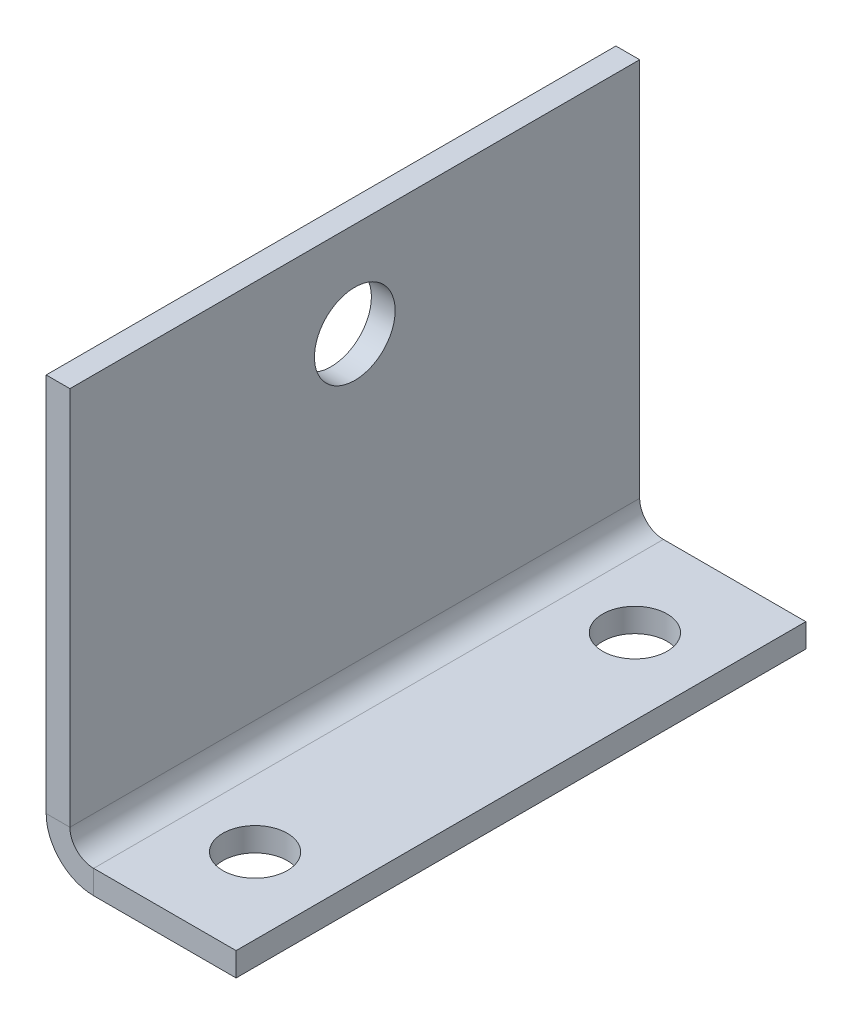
ISO-10303-21;
HEADER;
FILE_DESCRIPTION(('STEP AP214'),'2;1');
FILE_NAME('part.step','',(''),(''),'','','');
FILE_SCHEMA(('AUTOMOTIVE_DESIGN { 1 0 10303 214 1 1 1 1 }'));
ENDSEC;
DATA;
#1=APPLICATION_CONTEXT('core data for automotive mechanical design processes');
#2=APPLICATION_PROTOCOL_DEFINITION('international standard','automotive_design',2000,#1);
#3=PRODUCT_CONTEXT('',#1,'mechanical');
#4=PRODUCT('Part','Part','',(#3));
#5=PRODUCT_RELATED_PRODUCT_CATEGORY('part','',(#4));
#6=PRODUCT_DEFINITION_FORMATION('','',#4);
#7=PRODUCT_DEFINITION_CONTEXT('part definition',#1,'design');
#8=PRODUCT_DEFINITION('design','',#6,#7);
#9=PRODUCT_DEFINITION_SHAPE('','',#8);
#10=(LENGTH_UNIT() NAMED_UNIT(*) SI_UNIT(.MILLI.,.METRE.));
#11=(NAMED_UNIT(*) PLANE_ANGLE_UNIT() SI_UNIT($,.RADIAN.));
#12=(NAMED_UNIT(*) SI_UNIT($,.STERADIAN.) SOLID_ANGLE_UNIT());
#13=UNCERTAINTY_MEASURE_WITH_UNIT(LENGTH_MEASURE(1.E-05),#10,'distance_accuracy_value','');
#14=(GEOMETRIC_REPRESENTATION_CONTEXT(3) GLOBAL_UNCERTAINTY_ASSIGNED_CONTEXT((#13)) GLOBAL_UNIT_ASSIGNED_CONTEXT((#10,
#11,#12)) REPRESENTATION_CONTEXT('',''));
#15=CARTESIAN_POINT('',(0.,0.,0.));
#16=DIRECTION('',(0.,0.,1.));
#17=DIRECTION('',(1.,0.,0.));
#18=AXIS2_PLACEMENT_3D('',#15,#16,#17);
#19=CARTESIAN_POINT('',(-20.,4.99999999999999,30.));
#20=DIRECTION('',(0.,0.,1.));
#21=DIRECTION('',(1.,0.,0.));
#22=AXIS2_PLACEMENT_3D('',#19,#20,#21);
#23=PLANE('',#22);
#24=DIRECTION('',(1.,0.,0.));
#25=VECTOR('',#24,1.);
#26=CARTESIAN_POINT('',(-20.,4.99999999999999,30.));
#27=LINE('',#26,#25);
#28=CARTESIAN_POINT('',(-20.,4.99999999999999,30.));
#29=VERTEX_POINT('',#28);
#30=CARTESIAN_POINT('',(-17.5,4.99999999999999,30.));
#31=VERTEX_POINT('',#30);
#32=EDGE_CURVE('E11',#29,#31,#27,.T.);
#33=ORIENTED_EDGE('',*,*,#32,.F.);
#34=CARTESIAN_POINT('',(-15.,5.,30.));
#35=DIRECTION('',(0.,0.,1.));
#36=DIRECTION('',(1.,0.,0.));
#37=AXIS2_PLACEMENT_3D('',#34,#35,#36);
#38=CIRCLE('',#37,5.);
#39=CARTESIAN_POINT('',(-15.,0.,30.));
#40=VERTEX_POINT('',#39);
#41=EDGE_CURVE('E164',#40,#29,#38,.F.);
#42=ORIENTED_EDGE('',*,*,#41,.F.);
#43=DIRECTION('',(0.,-1.,0.));
#44=VECTOR('',#43,1.);
#45=CARTESIAN_POINT('',(-15.,2.5,30.));
#46=LINE('',#45,#44);
#47=CARTESIAN_POINT('',(-15.,2.5,30.));
#48=VERTEX_POINT('',#47);
#49=EDGE_CURVE('E46',#48,#40,#46,.T.);
#50=ORIENTED_EDGE('',*,*,#49,.F.);
#51=CARTESIAN_POINT('',(-15.,5.,30.));
#52=DIRECTION('',(0.,0.,1.));
#53=DIRECTION('',(1.,0.,0.));
#54=AXIS2_PLACEMENT_3D('',#51,#52,#53);
#55=CIRCLE('',#54,2.5);
#56=EDGE_CURVE('E178',#48,#31,#55,.F.);
#57=ORIENTED_EDGE('',*,*,#56,.T.);
#58=EDGE_LOOP('',(#33,#42,#50,#57));
#59=FACE_BOUND('',#58,.T.);
#60=ADVANCED_FACE('F38',(#59),#23,.T.);
#61=CARTESIAN_POINT('',(-15.,2.5,30.));
#62=DIRECTION('',(0.,0.,1.));
#63=DIRECTION('',(1.,0.,0.));
#64=AXIS2_PLACEMENT_3D('',#61,#62,#63);
#65=PLANE('',#64);
#66=DIRECTION('',(0.,1.,0.));
#67=VECTOR('',#66,1.);
#68=CARTESIAN_POINT('',(-20.,0.,30.));
#69=LINE('',#68,#67);
#70=CARTESIAN_POINT('',(-20.,45.,30.));
#71=VERTEX_POINT('',#70);
#72=EDGE_CURVE('E160',#29,#71,#69,.T.);
#73=ORIENTED_EDGE('',*,*,#72,.F.);
#74=ORIENTED_EDGE('',*,*,#32,.T.);
#75=DIRECTION('',(0.,1.,0.));
#76=VECTOR('',#75,1.);
#77=CARTESIAN_POINT('',(-17.5,0.,30.));
#78=LINE('',#77,#76);
#79=CARTESIAN_POINT('',(-17.5,45.,30.));
#80=VERTEX_POINT('',#79);
#81=EDGE_CURVE('E155',#31,#80,#78,.T.);
#82=ORIENTED_EDGE('',*,*,#81,.T.);
#83=DIRECTION('',(1.,0.,0.));
#84=VECTOR('',#83,1.);
#85=CARTESIAN_POINT('',(-20.,45.,30.));
#86=LINE('',#85,#84);
#87=EDGE_CURVE('E108',#71,#80,#86,.T.);
#88=ORIENTED_EDGE('',*,*,#87,.F.);
#89=EDGE_LOOP('',(#73,#74,#82,#88));
#90=FACE_BOUND('',#89,.T.);
#91=ADVANCED_FACE('F232',(#90),#65,.T.);
#92=CARTESIAN_POINT('',(-15.,0.,-30.));
#93=DIRECTION('',(0.,0.,-1.));
#94=DIRECTION('',(-1.,0.,0.));
#95=AXIS2_PLACEMENT_3D('',#92,#93,#94);
#96=PLANE('',#95);
#97=DIRECTION('',(0.,1.,0.));
#98=VECTOR('',#97,1.);
#99=CARTESIAN_POINT('',(-15.,0.,-30.));
#100=LINE('',#99,#98);
#101=CARTESIAN_POINT('',(-15.,0.,-30.));
#102=VERTEX_POINT('',#101);
#103=CARTESIAN_POINT('',(-15.,2.5,-30.));
#104=VERTEX_POINT('',#103);
#105=EDGE_CURVE('E205',#102,#104,#100,.T.);
#106=ORIENTED_EDGE('',*,*,#105,.F.);
#107=CARTESIAN_POINT('',(-15.,5.,-30.));
#108=DIRECTION('',(0.,0.,1.));
#109=DIRECTION('',(1.,0.,0.));
#110=AXIS2_PLACEMENT_3D('',#107,#108,#109);
#111=CIRCLE('',#110,5.);
#112=CARTESIAN_POINT('',(-20.,4.99999999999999,-30.));
#113=VERTEX_POINT('',#112);
#114=EDGE_CURVE('E132',#102,#113,#111,.F.);
#115=ORIENTED_EDGE('',*,*,#114,.T.);
#116=DIRECTION('',(-1.,0.,0.));
#117=VECTOR('',#116,1.);
#118=CARTESIAN_POINT('',(-17.5,4.99999999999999,-30.));
#119=LINE('',#118,#117);
#120=CARTESIAN_POINT('',(-17.5,4.99999999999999,-30.));
#121=VERTEX_POINT('',#120);
#122=EDGE_CURVE('E112',#121,#113,#119,.T.);
#123=ORIENTED_EDGE('',*,*,#122,.F.);
#124=CARTESIAN_POINT('',(-15.,5.,-30.));
#125=DIRECTION('',(0.,0.,1.));
#126=DIRECTION('',(1.,0.,0.));
#127=AXIS2_PLACEMENT_3D('',#124,#125,#126);
#128=CIRCLE('',#127,2.5);
#129=EDGE_CURVE('E151',#104,#121,#128,.F.);
#130=ORIENTED_EDGE('',*,*,#129,.F.);
#131=EDGE_LOOP('',(#106,#115,#123,#130));
#132=FACE_BOUND('',#131,.T.);
#133=ADVANCED_FACE('F236',(#132),#96,.T.);
#134=CARTESIAN_POINT('',(-17.5,4.99999999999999,-30.));
#135=DIRECTION('',(0.,0.,-1.));
#136=DIRECTION('',(-1.,0.,0.));
#137=AXIS2_PLACEMENT_3D('',#134,#135,#136);
#138=PLANE('',#137);
#139=DIRECTION('',(-1.,0.,0.));
#140=VECTOR('',#139,1.);
#141=CARTESIAN_POINT('',(0.,0.,-30.));
#142=LINE('',#141,#140);
#143=CARTESIAN_POINT('',(0.,0.,-30.));
#144=VERTEX_POINT('',#143);
#145=EDGE_CURVE('E139',#144,#102,#142,.T.);
#146=ORIENTED_EDGE('',*,*,#145,.T.);
#147=ORIENTED_EDGE('',*,*,#105,.T.);
#148=DIRECTION('',(-1.,0.,0.));
#149=VECTOR('',#148,1.);
#150=CARTESIAN_POINT('',(0.,2.5,-30.));
#151=LINE('',#150,#149);
#152=CARTESIAN_POINT('',(0.,2.5,-30.));
#153=VERTEX_POINT('',#152);
#154=EDGE_CURVE('E147',#153,#104,#151,.T.);
#155=ORIENTED_EDGE('',*,*,#154,.F.);
#156=DIRECTION('',(0.,-1.,0.));
#157=VECTOR('',#156,1.);
#158=CARTESIAN_POINT('',(0.,2.5,-30.));
#159=LINE('',#158,#157);
#160=EDGE_CURVE('E143',#153,#144,#159,.T.);
#161=ORIENTED_EDGE('',*,*,#160,.T.);
#162=EDGE_LOOP('',(#146,#147,#155,#161));
#163=FACE_BOUND('',#162,.T.);
#164=ADVANCED_FACE('F238',(#163),#138,.T.);
#165=CARTESIAN_POINT('',(-17.5,0.,30.));
#166=DIRECTION('',(-1.,0.,0.));
#167=DIRECTION('',(0.,0.,1.));
#168=AXIS2_PLACEMENT_3D('',#165,#166,#167);
#169=PLANE('',#168);
#170=CARTESIAN_POINT('',(-17.5,35.,0.));
#171=DIRECTION('',(1.,0.,0.));
#172=DIRECTION('',(0.,0.,-1.));
#173=AXIS2_PLACEMENT_3D('',#170,#171,#172);
#174=CIRCLE('',#173,4.25);
#175=CARTESIAN_POINT('',(-17.5,35.,-4.25));
#176=VERTEX_POINT('',#175);
#177=EDGE_CURVE('E434',#176,#176,#174,.T.);
#178=ORIENTED_EDGE('',*,*,#177,.F.);
#179=EDGE_LOOP('',(#178));
#180=FACE_BOUND('',#179,.T.);
#181=DIRECTION('',(0.,1.,0.));
#182=VECTOR('',#181,1.);
#183=CARTESIAN_POINT('',(-17.5,0.,-30.));
#184=LINE('',#183,#182);
#185=CARTESIAN_POINT('',(-17.5,45.,-30.));
#186=VERTEX_POINT('',#185);
#187=EDGE_CURVE('E117',#121,#186,#184,.T.);
#188=ORIENTED_EDGE('',*,*,#187,.T.);
#189=DIRECTION('',(0.,0.,-1.));
#190=VECTOR('',#189,1.);
#191=CARTESIAN_POINT('',(-17.5,45.,30.));
#192=LINE('',#191,#190);
#193=EDGE_CURVE('E101',#80,#186,#192,.T.);
#194=ORIENTED_EDGE('',*,*,#193,.F.);
#195=ORIENTED_EDGE('',*,*,#81,.F.);
#196=DIRECTION('',(0.,0.,-1.));
#197=VECTOR('',#196,1.);
#198=CARTESIAN_POINT('',(-17.5,4.99999999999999,30.));
#199=LINE('',#198,#197);
#200=EDGE_CURVE('E120',#31,#121,#199,.T.);
#201=ORIENTED_EDGE('',*,*,#200,.T.);
#202=EDGE_LOOP('',(#188,#194,#195,#201));
#203=FACE_BOUND('',#202,.T.);
#204=ADVANCED_FACE('F118',(#180,#203),#169,.F.);
#205=CARTESIAN_POINT('',(-20.,45.,30.));
#206=DIRECTION('',(0.,1.,0.));
#207=DIRECTION('',(0.,0.,1.));
#208=AXIS2_PLACEMENT_3D('',#205,#206,#207);
#209=PLANE('',#208);
#210=DIRECTION('',(1.,0.,0.));
#211=VECTOR('',#210,1.);
#212=CARTESIAN_POINT('',(-20.,45.,-30.));
#213=LINE('',#212,#211);
#214=CARTESIAN_POINT('',(-20.,45.,-30.));
#215=VERTEX_POINT('',#214);
#216=EDGE_CURVE('E105',#215,#186,#213,.T.);
#217=ORIENTED_EDGE('',*,*,#216,.F.);
#218=DIRECTION('',(0.,0.,-1.));
#219=VECTOR('',#218,1.);
#220=CARTESIAN_POINT('',(-20.,45.,30.));
#221=LINE('',#220,#219);
#222=EDGE_CURVE('E113',#71,#215,#221,.T.);
#223=ORIENTED_EDGE('',*,*,#222,.F.);
#224=ORIENTED_EDGE('',*,*,#87,.T.);
#225=ORIENTED_EDGE('',*,*,#193,.T.);
#226=EDGE_LOOP('',(#217,#223,#224,#225));
#227=FACE_BOUND('',#226,.T.);
#228=ADVANCED_FACE('F103',(#227),#209,.T.);
#229=CARTESIAN_POINT('',(-20.,0.,30.));
#230=DIRECTION('',(-1.,0.,0.));
#231=DIRECTION('',(0.,0.,1.));
#232=AXIS2_PLACEMENT_3D('',#229,#230,#231);
#233=PLANE('',#232);
#234=CARTESIAN_POINT('',(-20.,35.,0.));
#235=DIRECTION('',(1.,0.,0.));
#236=DIRECTION('',(0.,0.,-1.));
#237=AXIS2_PLACEMENT_3D('',#234,#235,#236);
#238=CIRCLE('',#237,4.25);
#239=CARTESIAN_POINT('',(-20.,35.,-4.25));
#240=VERTEX_POINT('',#239);
#241=EDGE_CURVE('E431',#240,#240,#238,.T.);
#242=ORIENTED_EDGE('',*,*,#241,.T.);
#243=EDGE_LOOP('',(#242));
#244=FACE_BOUND('',#243,.T.);
#245=DIRECTION('',(0.,1.,0.));
#246=VECTOR('',#245,1.);
#247=CARTESIAN_POINT('',(-20.,0.,-30.));
#248=LINE('',#247,#246);
#249=EDGE_CURVE('E127',#113,#215,#248,.T.);
#250=ORIENTED_EDGE('',*,*,#249,.F.);
#251=DIRECTION('',(0.,0.,-1.));
#252=VECTOR('',#251,1.);
#253=CARTESIAN_POINT('',(-20.,4.99999999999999,30.));
#254=LINE('',#253,#252);
#255=EDGE_CURVE('E197',#29,#113,#254,.T.);
#256=ORIENTED_EDGE('',*,*,#255,.F.);
#257=ORIENTED_EDGE('',*,*,#72,.T.);
#258=ORIENTED_EDGE('',*,*,#222,.T.);
#259=EDGE_LOOP('',(#250,#256,#257,#258));
#260=FACE_BOUND('',#259,.T.);
#261=ADVANCED_FACE('F234',(#244,#260),#233,.T.);
#262=CARTESIAN_POINT('',(-15.,5.,30.));
#263=DIRECTION('',(0.,0.,-1.));
#264=DIRECTION('',(-1.,0.,0.));
#265=AXIS2_PLACEMENT_3D('',#262,#263,#264);
#266=CYLINDRICAL_SURFACE('',#265,5.);
#267=ORIENTED_EDGE('',*,*,#114,.F.);
#268=DIRECTION('',(0.,0.,-1.));
#269=VECTOR('',#268,1.);
#270=CARTESIAN_POINT('',(-15.,0.,30.));
#271=LINE('',#270,#269);
#272=EDGE_CURVE('E193',#40,#102,#271,.T.);
#273=ORIENTED_EDGE('',*,*,#272,.F.);
#274=ORIENTED_EDGE('',*,*,#41,.T.);
#275=ORIENTED_EDGE('',*,*,#255,.T.);
#276=EDGE_LOOP('',(#267,#273,#274,#275));
#277=FACE_BOUND('',#276,.T.);
#278=ADVANCED_FACE('F217',(#277),#266,.T.);
#279=CARTESIAN_POINT('',(0.,0.,30.));
#280=DIRECTION('',(0.,-1.,0.));
#281=DIRECTION('',(1.,0.,0.));
#282=AXIS2_PLACEMENT_3D('',#279,#280,#281);
#283=PLANE('',#282);
#284=CARTESIAN_POINT('',(-8.,0.,20.));
#285=DIRECTION('',(0.,1.,0.));
#286=DIRECTION('',(0.,0.,1.));
#287=AXIS2_PLACEMENT_3D('',#284,#285,#286);
#288=CIRCLE('',#287,3.4);
#289=CARTESIAN_POINT('',(-8.,0.,23.4));
#290=VERTEX_POINT('',#289);
#291=EDGE_CURVE('E444',#290,#290,#288,.T.);
#292=ORIENTED_EDGE('',*,*,#291,.T.);
#293=EDGE_LOOP('',(#292));
#294=FACE_BOUND('',#293,.T.);
#295=CARTESIAN_POINT('',(-8.,0.,-20.));
#296=DIRECTION('',(0.,1.,0.));
#297=DIRECTION('',(0.,0.,1.));
#298=AXIS2_PLACEMENT_3D('',#295,#296,#297);
#299=CIRCLE('',#298,3.4);
#300=CARTESIAN_POINT('',(-8.,0.,-16.6));
#301=VERTEX_POINT('',#300);
#302=EDGE_CURVE('E123',#301,#301,#299,.T.);
#303=ORIENTED_EDGE('',*,*,#302,.T.);
#304=EDGE_LOOP('',(#303));
#305=FACE_BOUND('',#304,.T.);
#306=ORIENTED_EDGE('',*,*,#145,.F.);
#307=DIRECTION('',(0.,0.,-1.));
#308=VECTOR('',#307,1.);
#309=CARTESIAN_POINT('',(0.,0.,30.));
#310=LINE('',#309,#308);
#311=CARTESIAN_POINT('',(0.,0.,30.));
#312=VERTEX_POINT('',#311);
#313=EDGE_CURVE('E190',#312,#144,#310,.T.);
#314=ORIENTED_EDGE('',*,*,#313,.F.);
#315=DIRECTION('',(-1.,0.,0.));
#316=VECTOR('',#315,1.);
#317=CARTESIAN_POINT('',(0.,0.,30.));
#318=LINE('',#317,#316);
#319=EDGE_CURVE('E168',#312,#40,#318,.T.);
#320=ORIENTED_EDGE('',*,*,#319,.T.);
#321=ORIENTED_EDGE('',*,*,#272,.T.);
#322=EDGE_LOOP('',(#306,#314,#320,#321));
#323=FACE_BOUND('',#322,.T.);
#324=ADVANCED_FACE('F221',(#294,#305,#323),#283,.T.);
#325=CARTESIAN_POINT('',(0.,2.5,30.));
#326=DIRECTION('',(1.,0.,0.));
#327=DIRECTION('',(0.,1.,0.));
#328=AXIS2_PLACEMENT_3D('',#325,#326,#327);
#329=PLANE('',#328);
#330=ORIENTED_EDGE('',*,*,#160,.F.);
#331=DIRECTION('',(0.,0.,-1.));
#332=VECTOR('',#331,1.);
#333=CARTESIAN_POINT('',(0.,2.5,30.));
#334=LINE('',#333,#332);
#335=CARTESIAN_POINT('',(0.,2.5,30.));
#336=VERTEX_POINT('',#335);
#337=EDGE_CURVE('E187',#336,#153,#334,.T.);
#338=ORIENTED_EDGE('',*,*,#337,.F.);
#339=DIRECTION('',(0.,-1.,0.));
#340=VECTOR('',#339,1.);
#341=CARTESIAN_POINT('',(0.,2.5,30.));
#342=LINE('',#341,#340);
#343=EDGE_CURVE('E172',#336,#312,#342,.T.);
#344=ORIENTED_EDGE('',*,*,#343,.T.);
#345=ORIENTED_EDGE('',*,*,#313,.T.);
#346=EDGE_LOOP('',(#330,#338,#344,#345));
#347=FACE_BOUND('',#346,.T.);
#348=ADVANCED_FACE('F224',(#347),#329,.T.);
#349=CARTESIAN_POINT('',(0.,2.5,30.));
#350=DIRECTION('',(0.,-1.,0.));
#351=DIRECTION('',(1.,0.,0.));
#352=AXIS2_PLACEMENT_3D('',#349,#350,#351);
#353=PLANE('',#352);
#354=CARTESIAN_POINT('',(-8.,2.5,20.));
#355=DIRECTION('',(0.,1.,0.));
#356=DIRECTION('',(0.,0.,1.));
#357=AXIS2_PLACEMENT_3D('',#354,#355,#356);
#358=CIRCLE('',#357,3.39999999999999);
#359=CARTESIAN_POINT('',(-8.,2.5,23.4));
#360=VERTEX_POINT('',#359);
#361=EDGE_CURVE('E438',#360,#360,#358,.T.);
#362=ORIENTED_EDGE('',*,*,#361,.F.);
#363=EDGE_LOOP('',(#362));
#364=FACE_BOUND('',#363,.T.);
#365=CARTESIAN_POINT('',(-8.,2.5,-20.));
#366=DIRECTION('',(0.,1.,0.));
#367=DIRECTION('',(0.,0.,1.));
#368=AXIS2_PLACEMENT_3D('',#365,#366,#367);
#369=CIRCLE('',#368,3.39999999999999);
#370=CARTESIAN_POINT('',(-8.,2.5,-16.6));
#371=VERTEX_POINT('',#370);
#372=EDGE_CURVE('E448',#371,#371,#369,.T.);
#373=ORIENTED_EDGE('',*,*,#372,.F.);
#374=EDGE_LOOP('',(#373));
#375=FACE_BOUND('',#374,.T.);
#376=ORIENTED_EDGE('',*,*,#154,.T.);
#377=DIRECTION('',(0.,0.,-1.));
#378=VECTOR('',#377,1.);
#379=CARTESIAN_POINT('',(-15.,2.5,30.));
#380=LINE('',#379,#378);
#381=EDGE_CURVE('E183',#48,#104,#380,.T.);
#382=ORIENTED_EDGE('',*,*,#381,.F.);
#383=DIRECTION('',(-1.,0.,0.));
#384=VECTOR('',#383,1.);
#385=CARTESIAN_POINT('',(0.,2.5,30.));
#386=LINE('',#385,#384);
#387=EDGE_CURVE('E176',#336,#48,#386,.T.);
#388=ORIENTED_EDGE('',*,*,#387,.F.);
#389=ORIENTED_EDGE('',*,*,#337,.T.);
#390=EDGE_LOOP('',(#376,#382,#388,#389));
#391=FACE_BOUND('',#390,.T.);
#392=ADVANCED_FACE('F227',(#364,#375,#391),#353,.F.);
#393=CARTESIAN_POINT('',(-15.,5.,30.));
#394=DIRECTION('',(0.,0.,-1.));
#395=DIRECTION('',(-1.,0.,0.));
#396=AXIS2_PLACEMENT_3D('',#393,#394,#395);
#397=CYLINDRICAL_SURFACE('',#396,2.5);
#398=ORIENTED_EDGE('',*,*,#129,.T.);
#399=ORIENTED_EDGE('',*,*,#200,.F.);
#400=ORIENTED_EDGE('',*,*,#56,.F.);
#401=ORIENTED_EDGE('',*,*,#381,.T.);
#402=EDGE_LOOP('',(#398,#399,#400,#401));
#403=FACE_BOUND('',#402,.T.);
#404=ADVANCED_FACE('F231',(#403),#397,.F.);
#405=CARTESIAN_POINT('',(-15.,5.,30.));
#406=DIRECTION('',(0.,0.,1.));
#407=DIRECTION('',(1.,0.,0.));
#408=AXIS2_PLACEMENT_3D('',#405,#406,#407);
#409=PLANE('',#408);
#410=ORIENTED_EDGE('',*,*,#387,.T.);
#411=ORIENTED_EDGE('',*,*,#49,.T.);
#412=ORIENTED_EDGE('',*,*,#319,.F.);
#413=ORIENTED_EDGE('',*,*,#343,.F.);
#414=EDGE_LOOP('',(#410,#411,#412,#413));
#415=FACE_BOUND('',#414,.T.);
#416=ADVANCED_FACE('F211',(#415),#409,.T.);
#417=CARTESIAN_POINT('',(-15.,5.,-30.));
#418=DIRECTION('',(0.,0.,1.));
#419=DIRECTION('',(1.,0.,0.));
#420=AXIS2_PLACEMENT_3D('',#417,#418,#419);
#421=PLANE('',#420);
#422=ORIENTED_EDGE('',*,*,#187,.F.);
#423=ORIENTED_EDGE('',*,*,#122,.T.);
#424=ORIENTED_EDGE('',*,*,#249,.T.);
#425=ORIENTED_EDGE('',*,*,#216,.T.);
#426=EDGE_LOOP('',(#422,#423,#424,#425));
#427=FACE_BOUND('',#426,.T.);
#428=ADVANCED_FACE('F125',(#427),#421,.F.);
#429=CARTESIAN_POINT('',(-8.,2.5,-20.));
#430=DIRECTION('',(0.,1.,0.));
#431=DIRECTION('',(0.,0.,1.));
#432=AXIS2_PLACEMENT_3D('',#429,#430,#431);
#433=CYLINDRICAL_SURFACE('',#432,3.39999999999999);
#434=ORIENTED_EDGE('',*,*,#302,.F.);
#435=EDGE_LOOP('',(#434));
#436=FACE_BOUND('',#435,.T.);
#437=ORIENTED_EDGE('',*,*,#372,.T.);
#438=EDGE_LOOP('',(#437));
#439=FACE_BOUND('',#438,.T.);
#440=ADVANCED_FACE('F334',(#436,#439),#433,.F.);
#441=CARTESIAN_POINT('',(-8.,2.5,20.));
#442=DIRECTION('',(0.,1.,0.));
#443=DIRECTION('',(0.,0.,1.));
#444=AXIS2_PLACEMENT_3D('',#441,#442,#443);
#445=CYLINDRICAL_SURFACE('',#444,3.39999999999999);
#446=ORIENTED_EDGE('',*,*,#291,.F.);
#447=EDGE_LOOP('',(#446));
#448=FACE_BOUND('',#447,.T.);
#449=ORIENTED_EDGE('',*,*,#361,.T.);
#450=EDGE_LOOP('',(#449));
#451=FACE_BOUND('',#450,.T.);
#452=ADVANCED_FACE('F341',(#448,#451),#445,.F.);
#453=CARTESIAN_POINT('',(-17.5,35.,0.));
#454=DIRECTION('',(1.,0.,0.));
#455=DIRECTION('',(0.,0.,-1.));
#456=AXIS2_PLACEMENT_3D('',#453,#454,#455);
#457=CYLINDRICAL_SURFACE('',#456,4.25);
#458=ORIENTED_EDGE('',*,*,#241,.F.);
#459=EDGE_LOOP('',(#458));
#460=FACE_BOUND('',#459,.T.);
#461=ORIENTED_EDGE('',*,*,#177,.T.);
#462=EDGE_LOOP('',(#461));
#463=FACE_BOUND('',#462,.T.);
#464=ADVANCED_FACE('F349',(#460,#463),#457,.F.);
#465=CLOSED_SHELL('',(#60,#91,#133,#164,#204,#228,#261,#278,#324,#348,#392,#404,#416,#428,#440,
#452,#464));
#466=MANIFOLD_SOLID_BREP('B2',#465);
#467=ADVANCED_BREP_SHAPE_REPRESENTATION('',(#18,#466),#14);
#468=SHAPE_DEFINITION_REPRESENTATION(#9,#467);
ENDSEC;
END-ISO-10303-21;
